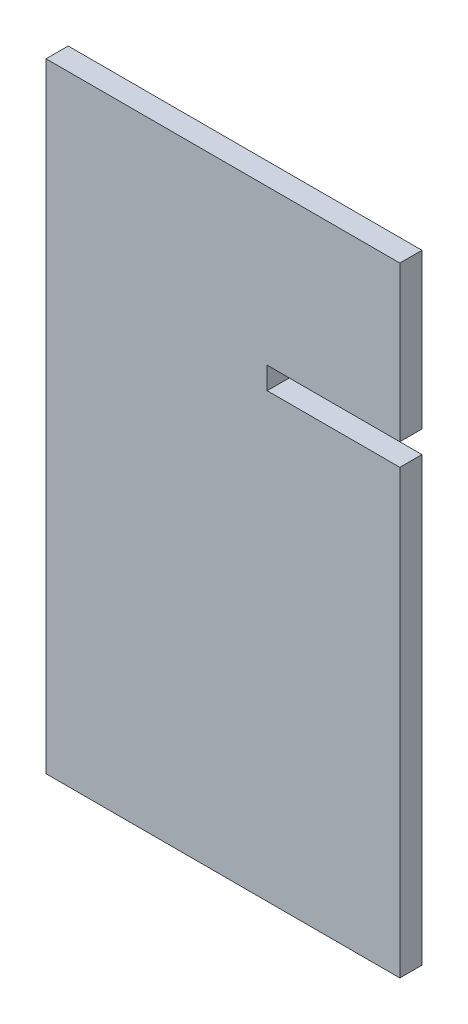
from build123d import *

# Parameters (mm, degrees)
BOSS_EXTRU_1_DEPTH = 5


with BuildPart() as part:
    # Esquisse1 → Boss.-Extru.1 (new body)
    with BuildSketch(Plane.XY):
        Polygon((54.516519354, 35.983333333), (54.516519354, 0.983333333), (24.516519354, 0.983333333), (24.516519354, -4.016666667), (54.516519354, -4.016666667), (54.516519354, -104.016666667), (-25.483480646, -104.016666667), (-25.483480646, 35.983333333), align=None)
    extrude(amount=BOSS_EXTRU_1_DEPTH)


solid = part.part
